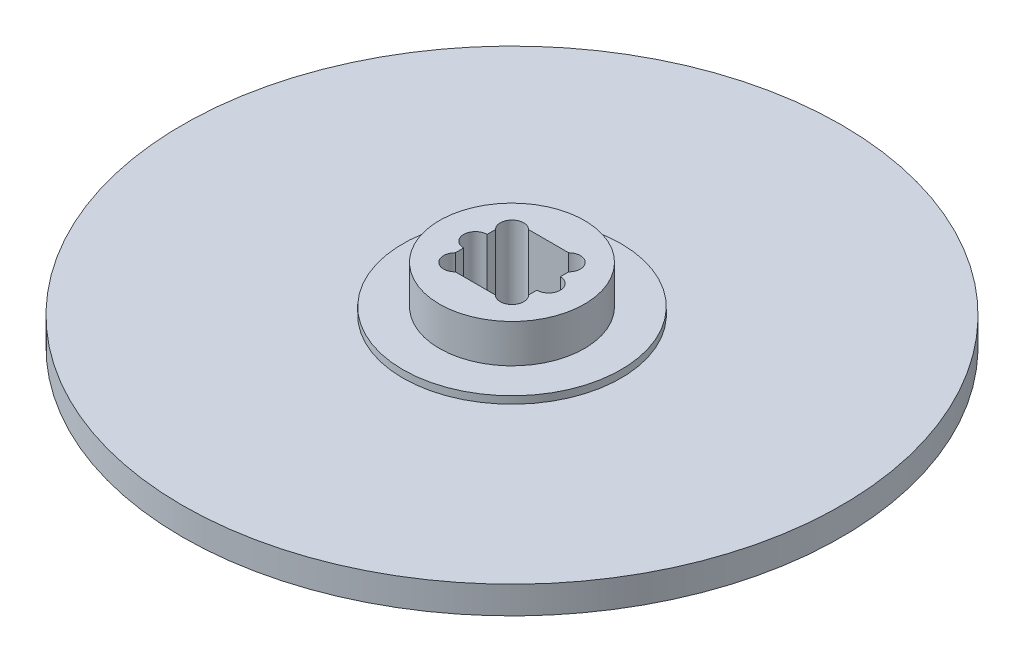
from build123d import *

# Parameters (mm, degrees)
ESQUISSE1_R             = 45
BOSS_EXTRU_1_DEPTH      = 3.75
ESQUISSE2_R             = 9.9
BOSS_EXTRU_2_DEPTH      = 6.25
ENL_V_MAT_EXTRU_1_DEPTH = 65.420493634
ESQUISSE4_R             = 1.6
ENL_V_MAT_EXTRU_2_DEPTH = 10
ESQUISSE5_R             = 14.9
ESQUISSE5_R_2           = 9.9
BOSS_EXTRU_3_DEPTH      = 1


with BuildPart() as part:
    # Esquisse1 → Boss.-Extru.1 (new body)
    with BuildSketch(Plane(origin=(0, 0, 0), x_dir=(1, 0, 0), z_dir=(0, 1, 0))):
        with Locations(Location((0, 0, 0), (0, 0, 270))):
            Circle(ESQUISSE1_R)
    extrude(amount=BOSS_EXTRU_1_DEPTH)

    # Esquisse2 → Boss.-Extru.2 (add)
    with BuildSketch(Plane(origin=(0, 3.75, 0), x_dir=(1, 0, 0), z_dir=(0, 1, 0))):
        with Locations(Location((0, 0, 0), (0, 0, 270))):
            Circle(ESQUISSE2_R)
    extrude(amount=BOSS_EXTRU_2_DEPTH)

    # Esquisse3 → Enl_v. mat.-Extru.1 (cut, through all)
    with BuildSketch(Plane(origin=(0, 10, 0), x_dir=(1, 0, 0), z_dir=(0, 1, 0))):
        with BuildLine():
            Line((-2.7372583, 5), (2.7372583, 5))
            ThreePointArc((2.7372583, 5), (5, 5), (5, 2.7372583))
            Line((5, 2.7372583), (5, -2.7372583))
            ThreePointArc((5, -2.7372583), (5, -5), (2.7372583, -5))
            Line((2.7372583, -5), (-2.7372583, -5))
            ThreePointArc((-2.7372583, -5), (-5, -5), (-5, -2.7372583))
            Line((-5, -2.7372583), (-5, 2.7372583))
            ThreePointArc((-5, 2.7372583), (-5, 5), (-2.7372583, 5))
        make_face()
    extrude(amount=-ENL_V_MAT_EXTRU_1_DEPTH, mode=Mode.SUBTRACT)

    # Esquisse4 → Enl_v. mat.-Extru.2 (cut)
    with BuildSketch(Plane(origin=(0, 0, 0), x_dir=(-1, 0, 0), z_dir=(0, -1, 0))):
        with Locations((5, 0)):
            Circle(ESQUISSE4_R)
        with Locations((-5, 0)):
            Circle(ESQUISSE4_R)
    extrude(amount=-ENL_V_MAT_EXTRU_2_DEPTH, mode=Mode.SUBTRACT)

    # Esquisse5 → Boss.-Extru.3 (add)
    with BuildSketch(Plane(origin=(0, 3.75, 0), x_dir=(1, 0, 0), z_dir=(0, 1, 0))):
        with Locations(Location((0, 0, 0), (0, 0, 270))):
            Circle(ESQUISSE5_R)
        with Locations(Location((0, 0, 0), (0, 0, 270))):
            Circle(ESQUISSE5_R_2, mode=Mode.SUBTRACT)
    extrude(amount=BOSS_EXTRU_3_DEPTH)


solid = part.part
